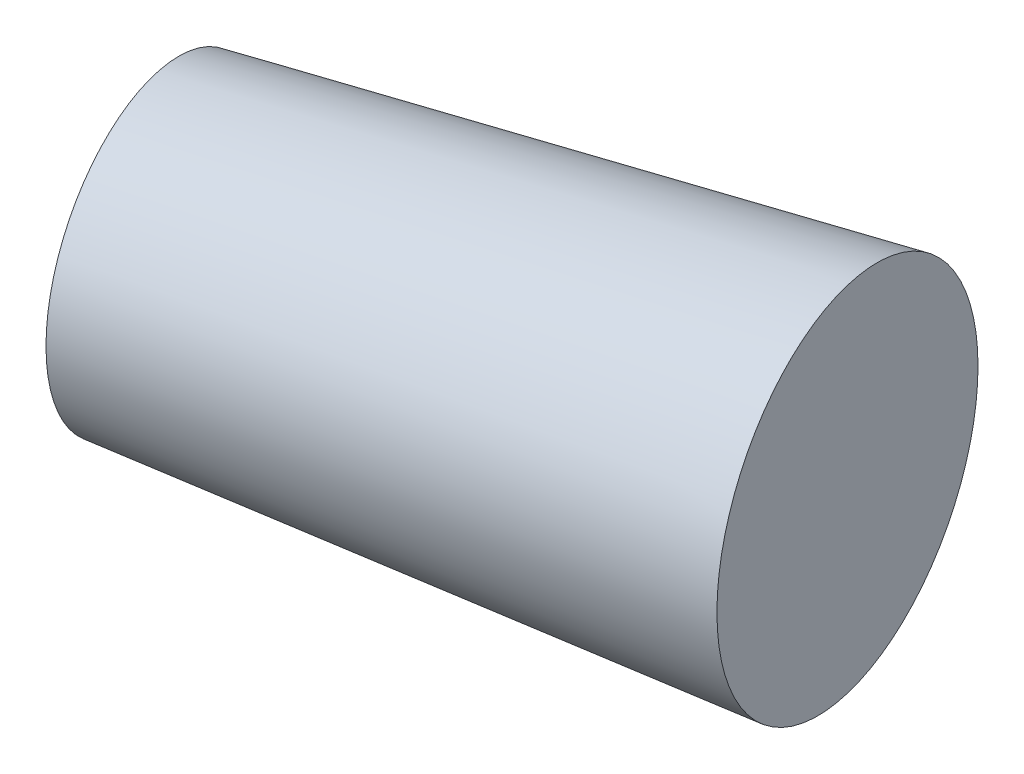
from build123d import *


with BuildPart() as part:
    # Esquisse1 → Base-R_volution (revolve)
    with BuildSketch(Plane(origin=(0, 0, 0), x_dir=(1, 0, 0), z_dir=(0, 1, 0))):
        Polygon((-6.589201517, -1.583119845), (4.086560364, 0.981835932), (3.298120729, 4.26344955), (-7.243217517, 1.139000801), align=None)
    revolve(axis=Axis((0, 0, 0), (0.9723299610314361, 0, -0.23361174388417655)))


solid = part.part
